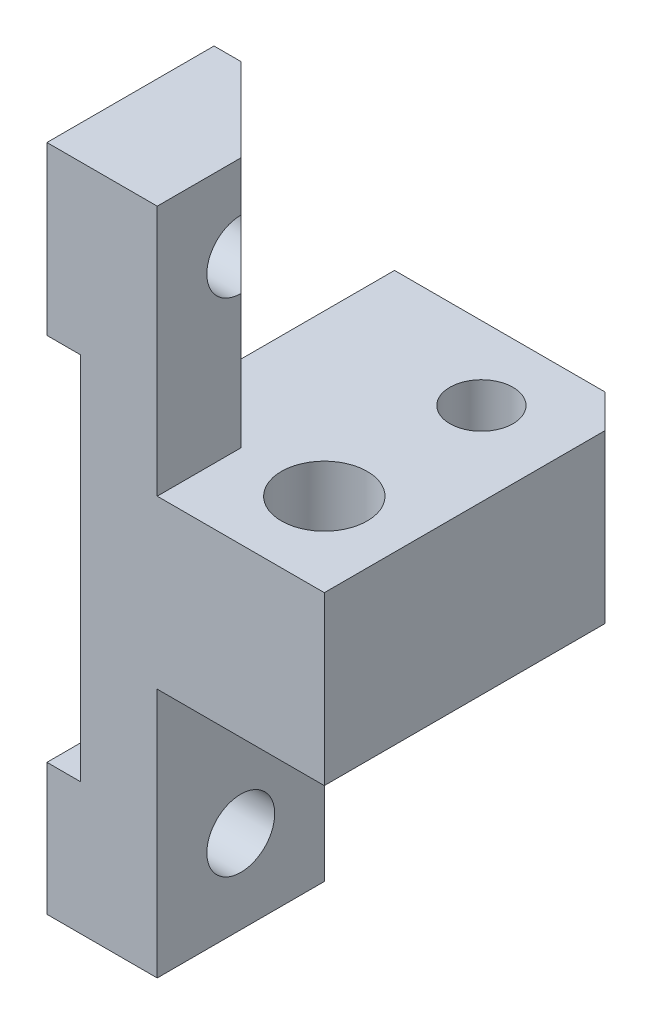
from build123d import *

# Parameters (mm, degrees)
SKETCH1_W                        = 4.191
SKETCH1_H                        = 25.4
EXTRUDE1_DEPTH                   = 6.35
SKETCH2_W                        = 6.35
SKETCH2_H                        = 6.35
EXTRUDE2_DEPTH                   = 6.35
F_30_0_128500_DIAMETER_HOLE1_D   = 3.2639
SKETCH7_W                        = 10.541
SKETCH7_H                        = 6.35
EXTRUDE3_DEPTH                   = 5.588
F_3_32_0_093750_DIAMETER_HOLE1_D = 2.4003
CHAMFER1_SIZE                    = 1.27
CHAMFER2_SIZE                    = 3.175
F_5_40_TAPPED_HOLE1_D            = 2.5781
SKETCH10_W                       = 11.938
SKETCH10_H                       = 14.047432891
CUT_EXTRUDE1_DEPTH               = 1.27


with BuildPart() as part:
    # Sketch1 → Extrude1 (new body)
    with BuildSketch(Plane.XY):
        with Locations((2.0955, 0)):
            Rectangle(SKETCH1_W, SKETCH1_H)
    extrude(amount=EXTRUDE1_DEPTH)

    # Sketch2 → Extrude2 (add)
    with BuildSketch(Plane(origin=(4.191, 0, 0), x_dir=(0, 0, -1), z_dir=(1, 0, 0))):
        with Locations((-3.175, -0.019174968)):
            Rectangle(SKETCH2_W, SKETCH2_H)
    extrude(amount=EXTRUDE2_DEPTH)

    # 30 _0.128500_ Diameter Hole1 (through all)
    with Locations(Plane(origin=(0, 3.155825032, 0), x_dir=(-1, 0, 0), z_dir=(0, 1, 0))):
        with Locations((-7.366, 3.175)):
            Hole(F_30_0_128500_DIAMETER_HOLE1_D / 2)

    # Sketch7 → Extrude3 (add)
    with BuildSketch(Plane(origin=(0, 0, 0), x_dir=(-1, 0, 0), z_dir=(0, 0, -1))):
        with Locations((-5.2705, -0.019174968)):
            Rectangle(SKETCH7_W, SKETCH7_H)
    extrude(amount=EXTRUDE3_DEPTH)

    # 3_32 _0.093750_ Diameter Hole1 (through all)
    with Locations(Plane(origin=(0, 3.155825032, 0), x_dir=(-1, 0, 0), z_dir=(0, 1, 0))):
        with Locations((-7.366, -2.794)):
            Hole(F_3_32_0_093750_DIAMETER_HOLE1_D / 2)

    # Chamfer1
    chamfer1_edges = [part.edges().sort_by_distance(p)[0] for p in [
        (10.541, -0.019174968, -5.588),
    ]]
    chamfer(chamfer1_edges, length=CHAMFER1_SIZE)

    # Chamfer2
    chamfer2_edges = [part.edges().sort_by_distance(p)[0] for p in [
        (4.191, 7.927912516, 0),
    ]]
    chamfer(chamfer2_edges, length=CHAMFER2_SIZE)

    # 5-40 Tapped Hole1 (through all)
    with Locations(Plane.ZY):
        with Locations((3.175, -9.525), (3.175, 9.525)):
            Hole(F_5_40_TAPPED_HOLE1_D / 2)

    # Sketch10 → Cut-Extrude1 (cut)
    with BuildSketch(Plane(origin=(0, 0, 6.35), x_dir=(0, 0, -1), z_dir=(1, 0, 0))):
        with Locations((5.969, -0.673716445)):
            Rectangle(SKETCH10_W, SKETCH10_H)
    extrude(amount=CUT_EXTRUDE1_DEPTH, mode=Mode.SUBTRACT)


solid = part.part
